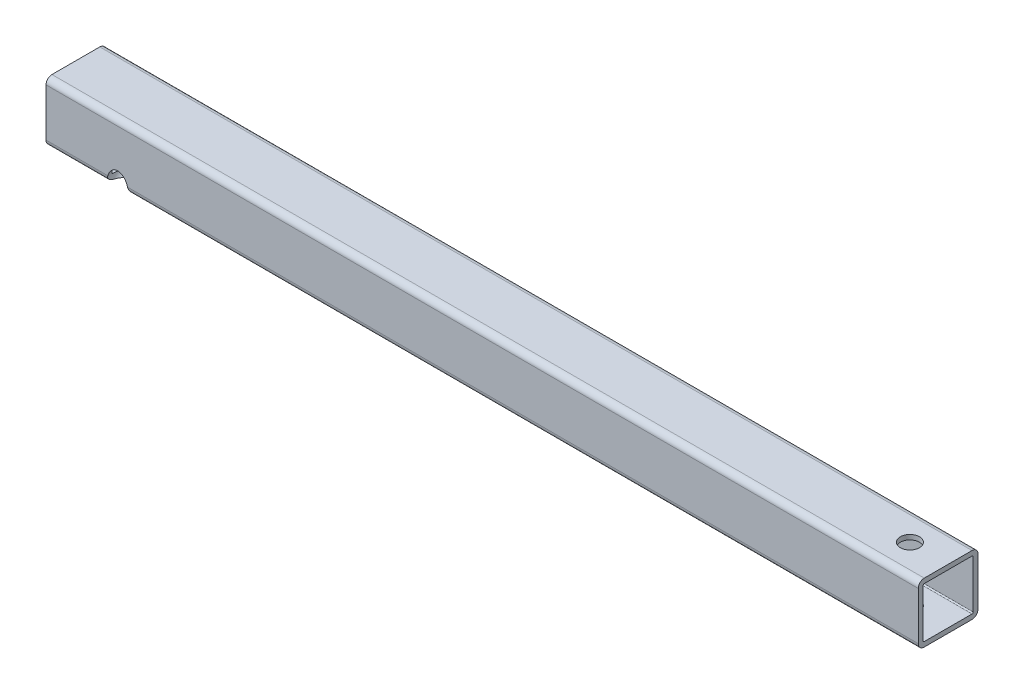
from build123d import *

# Parameters (mm, degrees)
BOSS_EXTRU_1_DEPTH      = 365
ESQUISSE2_R             = 4
ENL_V_MAT_EXTRU_1_DEPTH = 367.068641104
ENL_V_MAT_EXTRU_2_REACH = 368.61
ESQUISSE3_R             = 4.5


with BuildPart() as part:
    # Esquisse1 → Boss.-Extru.1 (new body)
    with BuildSketch(Plane(origin=(0, 0, 0), x_dir=(0, 0, -1), z_dir=(1, 0, 0))):
        with BuildLine():
            Line((-10, 12.5), (10, 12.5))
            ThreePointArc((10, 12.5), (11.767766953, 11.767766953), (12.5, 10))
            Line((12.5, 10), (12.5, -10))
            ThreePointArc((12.5, -10), (11.767766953, -11.767766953), (10, -12.5))
            Line((10, -12.5), (-10, -12.5))
            ThreePointArc((-10, -12.5), (-11.767766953, -11.767766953), (-12.5, -10))
            Line((-12.5, -10), (-12.5, 10))
            ThreePointArc((-12.5, 10), (-11.767766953, 11.767766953), (-10, 12.5))
        make_face()
        with BuildLine():
            Line((-10, 10.5), (10, 10.5))
            ThreePointArc((10, 10.5), (10.353553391, 10.353553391), (10.5, 10))
            Line((10.5, 10), (10.5, -10))
            ThreePointArc((10.5, -10), (10.353553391, -10.353553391), (10, -10.5))
            Line((10, -10.5), (-10, -10.5))
            ThreePointArc((-10, -10.5), (-10.353553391, -10.353553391), (-10.5, -10))
            Line((-10.5, -10), (-10.5, 10))
            ThreePointArc((-10.5, 10), (-10.353553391, 10.353553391), (-10, 10.5))
        make_face(mode=Mode.SUBTRACT)
    extrude(amount=BOSS_EXTRU_1_DEPTH)

    # Esquisse2 → Enl_v. mat.-Extru.1 (cut, through all)
    with BuildSketch(Plane.XZ.offset(-12.5)):
        with Locations(Location((349, 0, 0), (0, 0, 270))):
            Circle(ESQUISSE2_R)
    extrude(amount=ENL_V_MAT_EXTRU_1_DEPTH, mode=Mode.SUBTRACT)

    # Esquisse3 → Enl_v. mat.-Extru.2 (cut, up to next)
    with BuildSketch(Plane(origin=(0, -11.767766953, 11.767766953), x_dir=(-1, 0, 0), z_dir=(0, -0.7071067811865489, 0.7071067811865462)), mode=Mode.PRIVATE) as enl_v_mat_extru_2_sk1:
        with Locations(Location((-30, 0, 0), (0, 0, 23.131147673))):
            Circle(ESQUISSE3_R)
    enl_v_mat_extru_2_tool1 = extrude(enl_v_mat_extru_2_sk1.sketch, amount=-ENL_V_MAT_EXTRU_2_REACH, mode=Mode.PRIVATE) & part.part
    add(enl_v_mat_extru_2_tool1.solids().sort_by_distance((30, -11.767767, 11.767767))[0], mode=Mode.SUBTRACT)


solid = part.part
